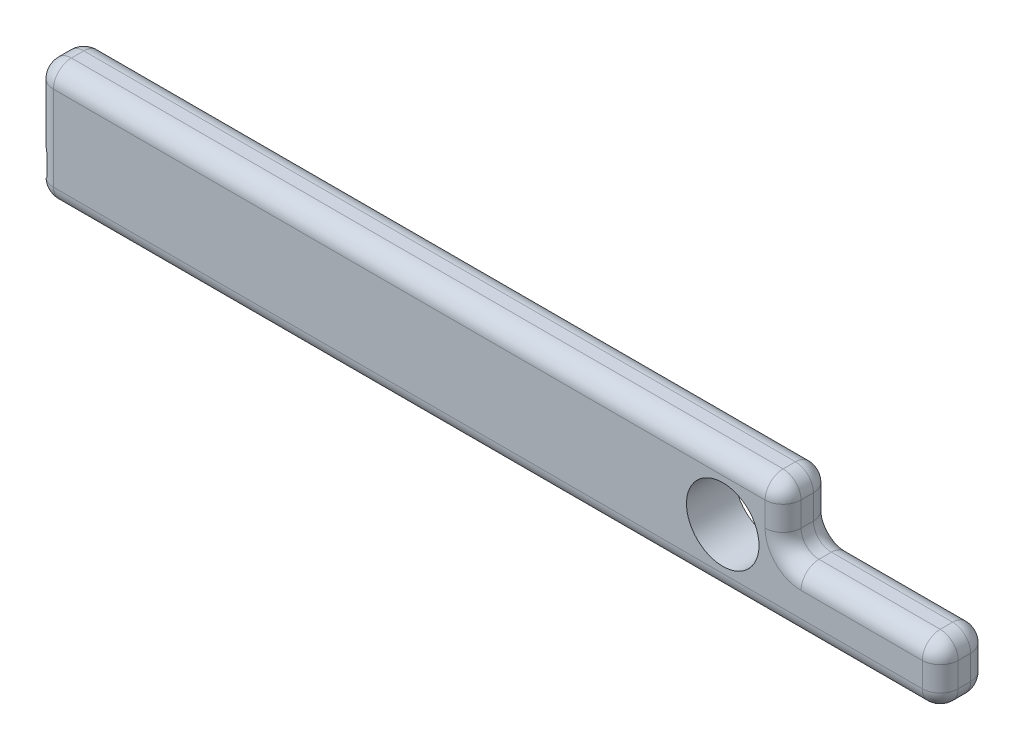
ISO-10303-21;
HEADER;
FILE_DESCRIPTION(('STEP AP214'),'2;1');
FILE_NAME('part.step','',(''),(''),'','','');
FILE_SCHEMA(('AUTOMOTIVE_DESIGN { 1 0 10303 214 1 1 1 1 }'));
ENDSEC;
DATA;
#1=APPLICATION_CONTEXT('core data for automotive mechanical design processes');
#2=APPLICATION_PROTOCOL_DEFINITION('international standard','automotive_design',2000,#1);
#3=PRODUCT_CONTEXT('',#1,'mechanical');
#4=PRODUCT('Part','Part','',(#3));
#5=PRODUCT_RELATED_PRODUCT_CATEGORY('part','',(#4));
#6=PRODUCT_DEFINITION_FORMATION('','',#4);
#7=PRODUCT_DEFINITION_CONTEXT('part definition',#1,'design');
#8=PRODUCT_DEFINITION('design','',#6,#7);
#9=PRODUCT_DEFINITION_SHAPE('','',#8);
#10=(LENGTH_UNIT() NAMED_UNIT(*) SI_UNIT(.MILLI.,.METRE.));
#11=(NAMED_UNIT(*) PLANE_ANGLE_UNIT() SI_UNIT($,.RADIAN.));
#12=(NAMED_UNIT(*) SI_UNIT($,.STERADIAN.) SOLID_ANGLE_UNIT());
#13=UNCERTAINTY_MEASURE_WITH_UNIT(LENGTH_MEASURE(1.E-05),#10,'distance_accuracy_value','');
#14=(GEOMETRIC_REPRESENTATION_CONTEXT(3) GLOBAL_UNCERTAINTY_ASSIGNED_CONTEXT((#13)) GLOBAL_UNIT_ASSIGNED_CONTEXT((#10,
#11,#12)) REPRESENTATION_CONTEXT('',''));
#15=CARTESIAN_POINT('',(0.,0.,0.));
#16=DIRECTION('',(0.,0.,1.));
#17=DIRECTION('',(1.,0.,0.));
#18=AXIS2_PLACEMENT_3D('',#15,#16,#17);
#19=CARTESIAN_POINT('',(26.2128,7.92479999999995,0.8128));
#20=DIRECTION('',(0.,1.,0.));
#21=DIRECTION('',(-1.,0.,0.));
#22=AXIS2_PLACEMENT_3D('',#19,#20,#21);
#23=CYLINDRICAL_SURFACE('',#22,2.3622);
#24=CARTESIAN_POINT('',(26.2128,-2.3622,0.8128));
#25=DIRECTION('',(0.,1.,0.));
#26=DIRECTION('',(-1.,0.,0.));
#27=AXIS2_PLACEMENT_3D('',#24,#25,#26);
#28=CIRCLE('',#27,2.3622);
#29=CARTESIAN_POINT('',(26.2128,-2.3622,3.175));
#30=VERTEX_POINT('',#29);
#31=CARTESIAN_POINT('',(28.575,-2.3622,0.812800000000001));
#32=VERTEX_POINT('',#31);
#33=EDGE_CURVE('E13',#30,#32,#28,.T.);
#34=ORIENTED_EDGE('',*,*,#33,.F.);
#35=DIRECTION('',(0.,1.,0.));
#36=VECTOR('',#35,1.);
#37=CARTESIAN_POINT('',(26.2128,7.92479999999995,3.175));
#38=LINE('',#37,#36);
#39=CARTESIAN_POINT('',(26.2128,-5.588,3.175));
#40=VERTEX_POINT('',#39);
#41=EDGE_CURVE('E310',#40,#30,#38,.T.);
#42=ORIENTED_EDGE('',*,*,#41,.F.);
#43=CARTESIAN_POINT('',(26.2128,-5.588,0.8128));
#44=DIRECTION('',(0.,1.,0.));
#45=DIRECTION('',(-1.,0.,0.));
#46=AXIS2_PLACEMENT_3D('',#43,#44,#45);
#47=CIRCLE('',#46,2.3622);
#48=CARTESIAN_POINT('',(28.575,-5.588,0.8128));
#49=VERTEX_POINT('',#48);
#50=EDGE_CURVE('E57',#40,#49,#47,.T.);
#51=ORIENTED_EDGE('',*,*,#50,.T.);
#52=DIRECTION('',(0.,1.,0.));
#53=VECTOR('',#52,1.);
#54=CARTESIAN_POINT('',(28.575,-7.9502,0.8128));
#55=LINE('',#54,#53);
#56=EDGE_CURVE('E284',#32,#49,#55,.F.);
#57=ORIENTED_EDGE('',*,*,#56,.F.);
#58=EDGE_LOOP('',(#34,#42,#51,#57));
#59=FACE_BOUND('',#58,.T.);
#60=ADVANCED_FACE('F48',(#59),#23,.T.);
#61=CARTESIAN_POINT('',(26.2128,-5.588,0.8128));
#62=DIRECTION('',(0.,0.,1.));
#63=DIRECTION('',(1.,0.,0.));
#64=AXIS2_PLACEMENT_3D('',#61,#62,#63);
#65=SPHERICAL_SURFACE('',#64,2.3622);
#66=ORIENTED_EDGE('',*,*,#50,.F.);
#67=CARTESIAN_POINT('',(26.2128,-5.588,0.8128));
#68=DIRECTION('',(1.,0.,0.));
#69=DIRECTION('',(0.,0.,-1.));
#70=AXIS2_PLACEMENT_3D('',#67,#68,#69);
#71=CIRCLE('',#70,2.3622);
#72=CARTESIAN_POINT('',(26.2128,-7.9502,0.8128));
#73=VERTEX_POINT('',#72);
#74=EDGE_CURVE('E334',#40,#73,#71,.T.);
#75=ORIENTED_EDGE('',*,*,#74,.T.);
#76=CARTESIAN_POINT('',(26.2128,-5.588,0.8128));
#77=DIRECTION('',(0.,0.,-1.));
#78=DIRECTION('',(-1.,0.,0.));
#79=AXIS2_PLACEMENT_3D('',#76,#77,#78);
#80=CIRCLE('',#79,2.3622);
#81=EDGE_CURVE('E290',#49,#73,#80,.T.);
#82=ORIENTED_EDGE('',*,*,#81,.F.);
#83=EDGE_LOOP('',(#66,#75,#82));
#84=FACE_BOUND('',#83,.T.);
#85=ADVANCED_FACE('F339',(#84),#65,.T.);
#86=CARTESIAN_POINT('',(-90.297,-5.588,0.8128));
#87=DIRECTION('',(1.,0.,0.));
#88=DIRECTION('',(0.,0.,-1.));
#89=AXIS2_PLACEMENT_3D('',#86,#87,#88);
#90=CYLINDRICAL_SURFACE('',#89,2.3622);
#91=ORIENTED_EDGE('',*,*,#74,.F.);
#92=DIRECTION('',(1.,0.,0.));
#93=VECTOR('',#92,1.);
#94=CARTESIAN_POINT('',(-90.297,-5.588,3.175));
#95=LINE('',#94,#93);
#96=CARTESIAN_POINT('',(-87.9348,-5.588,3.175));
#97=VERTEX_POINT('',#96);
#98=EDGE_CURVE('E313',#97,#40,#95,.T.);
#99=ORIENTED_EDGE('',*,*,#98,.F.);
#100=CARTESIAN_POINT('',(-87.9348,-5.588,0.8128));
#101=DIRECTION('',(1.,0.,0.));
#102=DIRECTION('',(0.,0.,-1.));
#103=AXIS2_PLACEMENT_3D('',#100,#101,#102);
#104=CIRCLE('',#103,2.3622);
#105=CARTESIAN_POINT('',(-87.9348,-7.9502,0.8128));
#106=VERTEX_POINT('',#105);
#107=EDGE_CURVE('E331',#97,#106,#104,.T.);
#108=ORIENTED_EDGE('',*,*,#107,.T.);
#109=DIRECTION('',(1.,0.,0.));
#110=VECTOR('',#109,1.);
#111=CARTESIAN_POINT('',(-90.297,-7.9502,0.8128));
#112=LINE('',#111,#110);
#113=EDGE_CURVE('E296',#73,#106,#112,.F.);
#114=ORIENTED_EDGE('',*,*,#113,.F.);
#115=EDGE_LOOP('',(#91,#99,#108,#114));
#116=FACE_BOUND('',#115,.T.);
#117=ADVANCED_FACE('F492',(#116),#90,.T.);
#118=CARTESIAN_POINT('',(-87.9348,-5.588,0.8128));
#119=DIRECTION('',(0.,0.,1.));
#120=DIRECTION('',(1.,0.,0.));
#121=AXIS2_PLACEMENT_3D('',#118,#119,#120);
#122=SPHERICAL_SURFACE('',#121,2.3622);
#123=CARTESIAN_POINT('',(-89.9096514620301,-6.88412904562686,0.8126));
#124=CARTESIAN_POINT('',(-89.9203523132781,-6.86784546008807,0.874150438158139));
#125=CARTESIAN_POINT('',(-89.9291557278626,-6.84960656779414,0.935512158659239));
#126=CARTESIAN_POINT('',(-89.9429635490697,-6.80931020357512,1.05740120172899));
#127=CARTESIAN_POINT('',(-89.9479680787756,-6.78725285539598,1.11792855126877));
#128=CARTESIAN_POINT('',(-89.9541651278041,-6.73948425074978,1.23751142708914));
#129=CARTESIAN_POINT('',(-89.9553693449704,-6.71378446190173,1.2965709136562));
#130=CARTESIAN_POINT('',(-89.9540005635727,-6.65887010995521,1.41296780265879));
#131=CARTESIAN_POINT('',(-89.9514276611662,-6.62965563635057,1.4703052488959));
#132=CARTESIAN_POINT('',(-89.9380307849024,-6.53700489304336,1.63923613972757));
#133=CARTESIAN_POINT('',(-89.9215281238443,-6.46856534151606,1.7477380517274));
#134=CARTESIAN_POINT('',(-89.8733809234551,-6.32091735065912,1.95357335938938));
#135=CARTESIAN_POINT('',(-89.8417243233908,-6.24170036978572,2.05089778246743));
#136=CARTESIAN_POINT('',(-89.7812547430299,-6.11386437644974,2.19083690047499));
#137=CARTESIAN_POINT('',(-89.757731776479,-6.06777140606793,2.23815653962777));
#138=CARTESIAN_POINT('',(-89.7062143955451,-5.97404949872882,2.32869916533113));
#139=CARTESIAN_POINT('',(-89.6782194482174,-5.92642037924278,2.37192166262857));
#140=CARTESIAN_POINT('',(-89.6177138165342,-5.83026544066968,2.45414700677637));
#141=CARTESIAN_POINT('',(-89.5851971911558,-5.78173851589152,2.49314418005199));
#142=CARTESIAN_POINT('',(-89.5156542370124,-5.68462315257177,2.566791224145));
#143=CARTESIAN_POINT('',(-89.478628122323,-5.6360347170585,2.60144130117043));
#144=CARTESIAN_POINT('',(-89.4393346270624,-5.58780000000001,2.63388878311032));
#145=B_SPLINE_CURVE_WITH_KNOTS('',3,(#123,#124,#125,#126,#127,#128,#129,#130,#131,#132,#133,
#134,#135,#136,#137,#138,#139,#140,#141,#142,#143,#144),.UNSPECIFIED.,.F.,.F.,(4,2,2,2,2,2,2,2,
2,2,4),(0.,0.193623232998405,0.387240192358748,0.580260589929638,0.773276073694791,
1.15933925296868,1.54571020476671,1.7558342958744,1.96598344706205,2.17641136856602,
2.38682930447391),.UNSPECIFIED.);
#146=CARTESIAN_POINT('',(-89.9096862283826,-6.88407608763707,0.8128));
#147=VERTEX_POINT('',#146);
#148=CARTESIAN_POINT('',(-89.4394975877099,-5.588,2.63375414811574));
#149=VERTEX_POINT('',#148);
#150=EDGE_CURVE('E507',#147,#149,#145,.T.);
#151=ORIENTED_EDGE('',*,*,#150,.F.);
#152=CARTESIAN_POINT('',(-87.9348,-5.588,0.8128));
#153=DIRECTION('',(0.,0.,1.));
#154=DIRECTION('',(1.,0.,0.));
#155=AXIS2_PLACEMENT_3D('',#152,#153,#154);
#156=CIRCLE('',#155,2.3622);
#157=EDGE_CURVE('E329',#147,#106,#156,.T.);
#158=ORIENTED_EDGE('',*,*,#157,.T.);
#159=ORIENTED_EDGE('',*,*,#107,.F.);
#160=CARTESIAN_POINT('',(-87.9348,-5.588,0.8128));
#161=DIRECTION('',(0.,-1.,0.));
#162=DIRECTION('',(0.,0.,-1.));
#163=AXIS2_PLACEMENT_3D('',#160,#161,#162);
#164=CIRCLE('',#163,2.3622);
#165=EDGE_CURVE('E308',#149,#97,#164,.F.);
#166=ORIENTED_EDGE('',*,*,#165,.F.);
#167=EDGE_LOOP('',(#151,#158,#159,#166));
#168=FACE_BOUND('',#167,.T.);
#169=ADVANCED_FACE('F497',(#168),#122,.T.);
#170=CARTESIAN_POINT('',(-87.9348,-5.588,3.175));
#171=DIRECTION('',(0.,0.,1.));
#172=DIRECTION('',(1.,0.,0.));
#173=AXIS2_PLACEMENT_3D('',#170,#171,#172);
#174=CYLINDRICAL_SURFACE('',#173,2.3622);
#175=CARTESIAN_POINT('',(-89.9096862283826,-6.88407608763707,-0.8128));
#176=CARTESIAN_POINT('',(-89.8971218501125,-6.90318926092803,-0.740658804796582));
#177=CARTESIAN_POINT('',(-89.8858389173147,-6.91980518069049,-0.667604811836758));
#178=CARTESIAN_POINT('',(-89.8663769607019,-6.94789490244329,-0.520055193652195));
#179=CARTESIAN_POINT('',(-89.8582002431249,-6.9593648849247,-0.445558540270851));
#180=CARTESIAN_POINT('',(-89.8456776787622,-6.97675620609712,-0.297573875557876));
#181=CARTESIAN_POINT('',(-89.8412373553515,-6.98281463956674,-0.224110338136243));
#182=CARTESIAN_POINT('',(-89.8361024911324,-6.98980342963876,-0.0768600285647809));
#183=CARTESIAN_POINT('',(-89.8354061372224,-6.99073626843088,-0.00307343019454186));
#184=CARTESIAN_POINT('',(-89.8386783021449,-6.98631414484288,0.195098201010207));
#185=CARTESIAN_POINT('',(-89.846184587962,-6.97619334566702,0.319380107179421));
#186=CARTESIAN_POINT('',(-89.8647442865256,-6.95013187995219,0.504823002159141));
#187=CARTESIAN_POINT('',(-89.8722759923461,-6.93944603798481,0.567173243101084));
#188=CARTESIAN_POINT('',(-89.8894722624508,-6.9144518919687,0.690817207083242));
#189=CARTESIAN_POINT('',(-89.8991358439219,-6.90014525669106,0.752111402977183));
#190=CARTESIAN_POINT('',(-89.9096862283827,-6.88407608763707,0.812799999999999));
#191=B_SPLINE_CURVE_WITH_KNOTS('',3,(#175,#176,#177,#178,#179,#180,#181,#182,#183,#184,#185,
#186,#187,#188,#189,#190),.UNSPECIFIED.,.F.,.F.,(4,2,2,2,2,2,2,4),(0.,0.227024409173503,
0.454217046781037,0.675475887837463,0.896627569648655,1.26988124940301,1.46087963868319,
1.65179015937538),.UNSPECIFIED.);
#192=CARTESIAN_POINT('',(-89.9096862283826,-6.88407608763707,-0.812799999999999));
#193=VERTEX_POINT('',#192);
#194=EDGE_CURVE('E514',#193,#147,#191,.T.);
#195=ORIENTED_EDGE('',*,*,#194,.F.);
#196=CARTESIAN_POINT('',(-87.9348,-5.588,-0.8128));
#197=DIRECTION('',(0.,0.,1.));
#198=DIRECTION('',(1.,0.,0.));
#199=AXIS2_PLACEMENT_3D('',#196,#197,#198);
#200=CIRCLE('',#199,2.3622);
#201=CARTESIAN_POINT('',(-87.9348,-7.9502,-0.8128));
#202=VERTEX_POINT('',#201);
#203=EDGE_CURVE('E327',#193,#202,#200,.T.);
#204=ORIENTED_EDGE('',*,*,#203,.T.);
#205=DIRECTION('',(0.,0.,1.));
#206=VECTOR('',#205,1.);
#207=CARTESIAN_POINT('',(-87.9348,-7.9502,3.175));
#208=LINE('',#207,#206);
#209=EDGE_CURVE('E299',#106,#202,#208,.F.);
#210=ORIENTED_EDGE('',*,*,#209,.F.);
#211=ORIENTED_EDGE('',*,*,#157,.F.);
#212=EDGE_LOOP('',(#195,#204,#210,#211));
#213=FACE_BOUND('',#212,.T.);
#214=ADVANCED_FACE('F502',(#213),#174,.T.);
#215=CARTESIAN_POINT('',(-87.9348,-5.588,-0.8128));
#216=DIRECTION('',(0.,0.,1.));
#217=DIRECTION('',(1.,0.,0.));
#218=AXIS2_PLACEMENT_3D('',#215,#216,#217);
#219=SPHERICAL_SURFACE('',#218,2.3622);
#220=CARTESIAN_POINT('',(-89.4393346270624,-5.5878,-2.63388878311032));
#221=CARTESIAN_POINT('',(-89.476403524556,-5.63330177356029,-2.60327655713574));
#222=CARTESIAN_POINT('',(-89.5114541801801,-5.67912060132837,-2.57070670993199));
#223=CARTESIAN_POINT('',(-89.5775385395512,-5.77073933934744,-2.50169856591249));
#224=CARTESIAN_POINT('',(-89.6085723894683,-5.81653925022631,-2.46526040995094));
#225=CARTESIAN_POINT('',(-89.6666265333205,-5.90744104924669,-2.38858507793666));
#226=CARTESIAN_POINT('',(-89.6936494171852,-5.95254337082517,-2.34835038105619));
#227=CARTESIAN_POINT('',(-89.7437101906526,-6.04148302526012,-2.2642011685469));
#228=CARTESIAN_POINT('',(-89.7667481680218,-6.08532038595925,-2.22028673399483));
#229=CARTESIAN_POINT('',(-89.829942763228,-6.21421978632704,-2.08314106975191));
#230=CARTESIAN_POINT('',(-89.8641571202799,-6.29663236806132,-1.98453797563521));
#231=CARTESIAN_POINT('',(-89.9165855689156,-6.45038562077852,-1.77526461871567));
#232=CARTESIAN_POINT('',(-89.9348094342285,-6.5217330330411,-1.6646017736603));
#233=CARTESIAN_POINT('',(-89.9501869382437,-6.61849745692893,-1.49156625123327));
#234=CARTESIAN_POINT('',(-89.9533108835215,-6.64911958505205,-1.43252521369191));
#235=CARTESIAN_POINT('',(-89.9555222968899,-6.70663041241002,-1.31255708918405));
#236=CARTESIAN_POINT('',(-89.9546096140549,-6.73351897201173,-1.25162993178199));
#237=CARTESIAN_POINT('',(-89.948735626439,-6.78342656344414,-1.12817742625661));
#238=CARTESIAN_POINT('',(-89.9437612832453,-6.80643284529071,-1.0656475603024));
#239=CARTESIAN_POINT('',(-89.9297513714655,-6.84836653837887,-0.939679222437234));
#240=CARTESIAN_POINT('',(-89.920715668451,-6.86729381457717,-0.876240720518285));
#241=CARTESIAN_POINT('',(-89.9096514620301,-6.88412904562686,-0.812600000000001));
#242=B_SPLINE_CURVE_WITH_KNOTS('',3,(#220,#221,#222,#223,#224,#225,#226,#227,#228,#229,#230,
#231,#232,#233,#234,#235,#236,#237,#238,#239,#240,#241),.UNSPECIFIED.,.F.,.F.,(4,2,2,2,2,2,2,2,
2,2,4),(0.,0.198511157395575,0.397015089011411,0.595390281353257,0.793761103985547,
1.19065968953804,1.5873155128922,1.78685181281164,1.98639557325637,2.18658242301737,
2.38677589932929),.UNSPECIFIED.);
#243=CARTESIAN_POINT('',(-89.4394975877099,-5.58800000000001,-2.63375414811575));
#244=VERTEX_POINT('',#243);
#245=EDGE_CURVE('E544',#244,#193,#242,.T.);
#246=ORIENTED_EDGE('',*,*,#245,.F.);
#247=CARTESIAN_POINT('',(-87.9348,-5.588,-0.8128));
#248=DIRECTION('',(0.,1.,0.));
#249=DIRECTION('',(0.,0.,1.));
#250=AXIS2_PLACEMENT_3D('',#247,#248,#249);
#251=CIRCLE('',#250,2.3622);
#252=CARTESIAN_POINT('',(-87.9348,-5.588,-3.175));
#253=VERTEX_POINT('',#252);
#254=EDGE_CURVE('E305',#253,#244,#251,.T.);
#255=ORIENTED_EDGE('',*,*,#254,.F.);
#256=CARTESIAN_POINT('',(-87.9348,-5.588,-0.8128));
#257=DIRECTION('',(-1.,0.,0.));
#258=DIRECTION('',(0.,0.,1.));
#259=AXIS2_PLACEMENT_3D('',#256,#257,#258);
#260=CIRCLE('',#259,2.3622);
#261=EDGE_CURVE('E324',#253,#202,#260,.T.);
#262=ORIENTED_EDGE('',*,*,#261,.T.);
#263=ORIENTED_EDGE('',*,*,#203,.F.);
#264=EDGE_LOOP('',(#246,#255,#262,#263));
#265=FACE_BOUND('',#264,.T.);
#266=ADVANCED_FACE('F588',(#265),#219,.T.);
#267=CARTESIAN_POINT('',(-90.297,-5.588,-0.8128));
#268=DIRECTION('',(1.,0.,0.));
#269=DIRECTION('',(0.,0.,-1.));
#270=AXIS2_PLACEMENT_3D('',#267,#268,#269);
#271=CYLINDRICAL_SURFACE('',#270,2.3622);
#272=ORIENTED_EDGE('',*,*,#261,.F.);
#273=DIRECTION('',(-1.,0.,0.));
#274=VECTOR('',#273,1.);
#275=CARTESIAN_POINT('',(-90.297,-5.588,-3.175));
#276=LINE('',#275,#274);
#277=CARTESIAN_POINT('',(26.2128,-5.588,-3.175));
#278=VERTEX_POINT('',#277);
#279=EDGE_CURVE('E278',#278,#253,#276,.T.);
#280=ORIENTED_EDGE('',*,*,#279,.F.);
#281=CARTESIAN_POINT('',(26.2128,-5.588,-0.8128));
#282=DIRECTION('',(-1.,0.,0.));
#283=DIRECTION('',(0.,0.,1.));
#284=AXIS2_PLACEMENT_3D('',#281,#282,#283);
#285=CIRCLE('',#284,2.3622);
#286=CARTESIAN_POINT('',(26.2128,-7.9502,-0.8128));
#287=VERTEX_POINT('',#286);
#288=EDGE_CURVE('E322',#278,#287,#285,.T.);
#289=ORIENTED_EDGE('',*,*,#288,.T.);
#290=DIRECTION('',(-1.,0.,0.));
#291=VECTOR('',#290,1.);
#292=CARTESIAN_POINT('',(-90.297,-7.9502,-0.8128));
#293=LINE('',#292,#291);
#294=EDGE_CURVE('E302',#202,#287,#293,.F.);
#295=ORIENTED_EDGE('',*,*,#294,.F.);
#296=EDGE_LOOP('',(#272,#280,#289,#295));
#297=FACE_BOUND('',#296,.T.);
#298=ADVANCED_FACE('F586',(#297),#271,.T.);
#299=CARTESIAN_POINT('',(26.2128,-5.588,-0.8128));
#300=DIRECTION('',(0.,0.,1.));
#301=DIRECTION('',(1.,0.,0.));
#302=AXIS2_PLACEMENT_3D('',#299,#300,#301);
#303=SPHERICAL_SURFACE('',#302,2.3622);
#304=ORIENTED_EDGE('',*,*,#288,.F.);
#305=CARTESIAN_POINT('',(26.2128,-5.588,-0.8128));
#306=DIRECTION('',(0.,-1.,0.));
#307=DIRECTION('',(1.,0.,0.));
#308=AXIS2_PLACEMENT_3D('',#305,#306,#307);
#309=CIRCLE('',#308,2.3622);
#310=CARTESIAN_POINT('',(28.575,-5.588,-0.8128));
#311=VERTEX_POINT('',#310);
#312=EDGE_CURVE('E320',#278,#311,#309,.T.);
#313=ORIENTED_EDGE('',*,*,#312,.T.);
#314=CARTESIAN_POINT('',(26.2128,-5.588,-0.8128));
#315=DIRECTION('',(0.,0.,-1.));
#316=DIRECTION('',(-1.,0.,0.));
#317=AXIS2_PLACEMENT_3D('',#314,#315,#316);
#318=CIRCLE('',#317,2.3622);
#319=EDGE_CURVE('E293',#287,#311,#318,.F.);
#320=ORIENTED_EDGE('',*,*,#319,.F.);
#321=EDGE_LOOP('',(#304,#313,#320));
#322=FACE_BOUND('',#321,.T.);
#323=ADVANCED_FACE('F583',(#322),#303,.T.);
#324=CARTESIAN_POINT('',(26.2128,7.92479999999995,-0.8128));
#325=DIRECTION('',(0.,1.,0.));
#326=DIRECTION('',(-1.,0.,0.));
#327=AXIS2_PLACEMENT_3D('',#324,#325,#326);
#328=CYLINDRICAL_SURFACE('',#327,2.3622);
#329=ORIENTED_EDGE('',*,*,#312,.F.);
#330=DIRECTION('',(0.,-1.,0.));
#331=VECTOR('',#330,1.);
#332=CARTESIAN_POINT('',(26.2128,7.92479999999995,-3.175));
#333=LINE('',#332,#331);
#334=CARTESIAN_POINT('',(26.2128,-2.3622,-3.175));
#335=VERTEX_POINT('',#334);
#336=EDGE_CURVE('E281',#335,#278,#333,.T.);
#337=ORIENTED_EDGE('',*,*,#336,.F.);
#338=CARTESIAN_POINT('',(26.2128,-2.3622,-0.8128));
#339=DIRECTION('',(0.,-1.,0.));
#340=DIRECTION('',(1.,0.,0.));
#341=AXIS2_PLACEMENT_3D('',#338,#339,#340);
#342=CIRCLE('',#341,2.3622);
#343=CARTESIAN_POINT('',(28.575,-2.3622,-0.8128));
#344=VERTEX_POINT('',#343);
#345=EDGE_CURVE('E318',#335,#344,#342,.T.);
#346=ORIENTED_EDGE('',*,*,#345,.T.);
#347=DIRECTION('',(0.,-1.,0.));
#348=VECTOR('',#347,1.);
#349=CARTESIAN_POINT('',(28.575,7.92479999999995,-0.8128));
#350=LINE('',#349,#348);
#351=EDGE_CURVE('E287',#311,#344,#350,.F.);
#352=ORIENTED_EDGE('',*,*,#351,.F.);
#353=EDGE_LOOP('',(#329,#337,#346,#352));
#354=FACE_BOUND('',#353,.T.);
#355=ADVANCED_FACE('F355',(#354),#328,.T.);
#356=CARTESIAN_POINT('',(26.2128,-2.3622,-0.8128));
#357=DIRECTION('',(0.,0.,1.));
#358=DIRECTION('',(1.,0.,0.));
#359=AXIS2_PLACEMENT_3D('',#356,#357,#358);
#360=SPHERICAL_SURFACE('',#359,2.3622);
#361=ORIENTED_EDGE('',*,*,#345,.F.);
#362=CARTESIAN_POINT('',(26.2128,-2.3622,-0.8128));
#363=DIRECTION('',(1.,0.,0.));
#364=DIRECTION('',(0.,0.,-1.));
#365=AXIS2_PLACEMENT_3D('',#362,#363,#364);
#366=CIRCLE('',#365,2.3622);
#367=CARTESIAN_POINT('',(26.2128,0.,-0.8128));
#368=VERTEX_POINT('',#367);
#369=EDGE_CURVE('E270',#368,#335,#366,.F.);
#370=ORIENTED_EDGE('',*,*,#369,.F.);
#371=CARTESIAN_POINT('',(26.2128,-2.3622,-0.812800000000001));
#372=DIRECTION('',(0.,0.,1.));
#373=DIRECTION('',(1.,0.,0.));
#374=AXIS2_PLACEMENT_3D('',#371,#372,#373);
#375=CIRCLE('',#374,2.3622);
#376=EDGE_CURVE('E276',#344,#368,#375,.T.);
#377=ORIENTED_EDGE('',*,*,#376,.F.);
#378=EDGE_LOOP('',(#361,#370,#377));
#379=FACE_BOUND('',#378,.T.);
#380=ADVANCED_FACE('F360',(#379),#360,.T.);
#381=CARTESIAN_POINT('',(26.2128,-2.3622,0.812800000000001));
#382=DIRECTION('',(0.,0.,1.));
#383=DIRECTION('',(1.,0.,0.));
#384=AXIS2_PLACEMENT_3D('',#381,#382,#383);
#385=SPHERICAL_SURFACE('',#384,2.3622);
#386=CARTESIAN_POINT('',(26.2128,-2.3622,0.812800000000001));
#387=DIRECTION('',(-1.,0.,0.));
#388=DIRECTION('',(0.,0.,1.));
#389=AXIS2_PLACEMENT_3D('',#386,#387,#388);
#390=CIRCLE('',#389,2.3622);
#391=CARTESIAN_POINT('',(26.2128,0.,0.812800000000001));
#392=VERTEX_POINT('',#391);
#393=EDGE_CURVE('E316',#30,#392,#390,.T.);
#394=ORIENTED_EDGE('',*,*,#393,.F.);
#395=ORIENTED_EDGE('',*,*,#33,.T.);
#396=CARTESIAN_POINT('',(26.2128,-2.3622,0.812800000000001));
#397=DIRECTION('',(0.,0.,1.));
#398=DIRECTION('',(1.,0.,0.));
#399=AXIS2_PLACEMENT_3D('',#396,#397,#398);
#400=CIRCLE('',#399,2.3622);
#401=EDGE_CURVE('E273',#392,#32,#400,.F.);
#402=ORIENTED_EDGE('',*,*,#401,.F.);
#403=EDGE_LOOP('',(#394,#395,#402));
#404=FACE_BOUND('',#403,.T.);
#405=ADVANCED_FACE('F50',(#404),#385,.T.);
#406=CARTESIAN_POINT('',(26.2128,-5.588,3.175));
#407=DIRECTION('',(0.,0.,-1.));
#408=DIRECTION('',(-1.,0.,0.));
#409=AXIS2_PLACEMENT_3D('',#406,#407,#408);
#410=CYLINDRICAL_SURFACE('',#409,2.3622);
#411=DIRECTION('',(0.,0.,-1.));
#412=VECTOR('',#411,1.);
#413=CARTESIAN_POINT('',(26.2128,-7.9502,3.175));
#414=LINE('',#413,#412);
#415=EDGE_CURVE('E267',#287,#73,#414,.F.);
#416=ORIENTED_EDGE('',*,*,#415,.F.);
#417=ORIENTED_EDGE('',*,*,#319,.T.);
#418=DIRECTION('',(0.,0.,-1.));
#419=VECTOR('',#418,1.);
#420=CARTESIAN_POINT('',(28.575,-5.588,3.175));
#421=LINE('',#420,#419);
#422=EDGE_CURVE('E264',#49,#311,#421,.T.);
#423=ORIENTED_EDGE('',*,*,#422,.F.);
#424=ORIENTED_EDGE('',*,*,#81,.T.);
#425=EDGE_LOOP('',(#416,#417,#423,#424));
#426=FACE_BOUND('',#425,.T.);
#427=ADVANCED_FACE('F349',(#426),#410,.T.);
#428=CARTESIAN_POINT('',(-87.9348,5.5626,0.8128));
#429=DIRECTION('',(0.,0.,1.));
#430=DIRECTION('',(1.,0.,0.));
#431=AXIS2_PLACEMENT_3D('',#428,#429,#430);
#432=SPHERICAL_SURFACE('',#431,2.3622);
#433=CARTESIAN_POINT('',(-87.9348,5.5626,0.8128));
#434=DIRECTION('',(0.,-1.,0.));
#435=DIRECTION('',(0.,0.,-1.));
#436=AXIS2_PLACEMENT_3D('',#433,#434,#435);
#437=CIRCLE('',#436,2.3622);
#438=CARTESIAN_POINT('',(-87.9348,5.5626,3.175));
#439=VERTEX_POINT('',#438);
#440=CARTESIAN_POINT('',(-90.297,5.5626,0.8128));
#441=VERTEX_POINT('',#440);
#442=EDGE_CURVE('E261',#439,#441,#437,.T.);
#443=ORIENTED_EDGE('',*,*,#442,.F.);
#444=CARTESIAN_POINT('',(-87.9348,5.5626,0.8128));
#445=DIRECTION('',(-1.,0.,0.));
#446=DIRECTION('',(0.,0.,1.));
#447=AXIS2_PLACEMENT_3D('',#444,#445,#446);
#448=CIRCLE('',#447,2.3622);
#449=CARTESIAN_POINT('',(-87.9348,7.9248,0.8128));
#450=VERTEX_POINT('',#449);
#451=EDGE_CURVE('E259',#439,#450,#448,.T.);
#452=ORIENTED_EDGE('',*,*,#451,.T.);
#453=CARTESIAN_POINT('',(-87.9348,5.5626,0.8128));
#454=DIRECTION('',(0.,0.,1.));
#455=DIRECTION('',(1.,0.,0.));
#456=AXIS2_PLACEMENT_3D('',#453,#454,#455);
#457=CIRCLE('',#456,2.3622);
#458=EDGE_CURVE('E252',#441,#450,#457,.F.);
#459=ORIENTED_EDGE('',*,*,#458,.F.);
#460=EDGE_LOOP('',(#443,#452,#459));
#461=FACE_BOUND('',#460,.T.);
#462=ADVANCED_FACE('F485',(#461),#432,.T.);
#463=CARTESIAN_POINT('',(-90.297,5.5626,0.8128));
#464=DIRECTION('',(-1.,0.,0.));
#465=DIRECTION('',(0.,0.,1.));
#466=AXIS2_PLACEMENT_3D('',#463,#464,#465);
#467=CYLINDRICAL_SURFACE('',#466,2.3622);
#468=ORIENTED_EDGE('',*,*,#451,.F.);
#469=DIRECTION('',(-1.,0.,0.));
#470=VECTOR('',#469,1.);
#471=CARTESIAN_POINT('',(-90.297,5.5626,3.175));
#472=LINE('',#471,#470);
#473=CARTESIAN_POINT('',(5.5626,5.5626,3.175));
#474=VERTEX_POINT('',#473);
#475=EDGE_CURVE('E246',#474,#439,#472,.T.);
#476=ORIENTED_EDGE('',*,*,#475,.F.);
#477=CARTESIAN_POINT('',(5.5626,5.5626,0.8128));
#478=DIRECTION('',(-1.,0.,0.));
#479=DIRECTION('',(0.,0.,1.));
#480=AXIS2_PLACEMENT_3D('',#477,#478,#479);
#481=CIRCLE('',#480,2.3622);
#482=CARTESIAN_POINT('',(5.5626,7.9248,0.8128));
#483=VERTEX_POINT('',#482);
#484=EDGE_CURVE('E257',#474,#483,#481,.T.);
#485=ORIENTED_EDGE('',*,*,#484,.T.);
#486=DIRECTION('',(-1.,0.,0.));
#487=VECTOR('',#486,1.);
#488=CARTESIAN_POINT('',(-90.297,7.9248,0.8128));
#489=LINE('',#488,#487);
#490=EDGE_CURVE('E249',#450,#483,#489,.F.);
#491=ORIENTED_EDGE('',*,*,#490,.F.);
#492=EDGE_LOOP('',(#468,#476,#485,#491));
#493=FACE_BOUND('',#492,.T.);
#494=ADVANCED_FACE('F569',(#493),#467,.T.);
#495=CARTESIAN_POINT('',(5.5626,5.5626,0.8128));
#496=DIRECTION('',(0.,0.,1.));
#497=DIRECTION('',(1.,0.,0.));
#498=AXIS2_PLACEMENT_3D('',#495,#496,#497);
#499=SPHERICAL_SURFACE('',#498,2.3622);
#500=ORIENTED_EDGE('',*,*,#484,.F.);
#501=CARTESIAN_POINT('',(5.5626,5.5626,0.8128));
#502=DIRECTION('',(0.,1.,0.));
#503=DIRECTION('',(0.,0.,1.));
#504=AXIS2_PLACEMENT_3D('',#501,#502,#503);
#505=CIRCLE('',#504,2.3622);
#506=CARTESIAN_POINT('',(7.9248,5.5626,0.8128));
#507=VERTEX_POINT('',#506);
#508=EDGE_CURVE('E238',#507,#474,#505,.F.);
#509=ORIENTED_EDGE('',*,*,#508,.F.);
#510=CARTESIAN_POINT('',(5.5626,5.5626,0.8128));
#511=DIRECTION('',(0.,0.,-1.));
#512=DIRECTION('',(-1.,0.,0.));
#513=AXIS2_PLACEMENT_3D('',#510,#511,#512);
#514=CIRCLE('',#513,2.3622);
#515=EDGE_CURVE('E241',#483,#507,#514,.T.);
#516=ORIENTED_EDGE('',*,*,#515,.F.);
#517=EDGE_LOOP('',(#500,#509,#516));
#518=FACE_BOUND('',#517,.T.);
#519=ADVANCED_FACE('F564',(#518),#499,.T.);
#520=CARTESIAN_POINT('',(-87.9348,7.9248,0.8128));
#521=DIRECTION('',(0.,-1.,0.));
#522=DIRECTION('',(0.,0.,-1.));
#523=AXIS2_PLACEMENT_3D('',#520,#521,#522);
#524=CYLINDRICAL_SURFACE('',#523,2.3622);
#525=CARTESIAN_POINT('',(-89.4394975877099,-5.588,2.63375414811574));
#526=CARTESIAN_POINT('',(-89.4066985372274,-5.54774322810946,2.66085495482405));
#527=CARTESIAN_POINT('',(-89.3734314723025,-5.50713293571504,2.6868550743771));
#528=CARTESIAN_POINT('',(-89.3061158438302,-5.42534705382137,2.73665901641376));
#529=CARTESIAN_POINT('',(-89.272068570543,-5.38417243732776,2.76046617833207));
#530=CARTESIAN_POINT('',(-89.2032458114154,-5.30127565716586,2.80597230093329));
#531=CARTESIAN_POINT('',(-89.1684703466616,-5.25955350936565,2.82767132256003));
#532=CARTESIAN_POINT('',(-89.0982232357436,-5.17556197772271,2.86903389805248));
#533=CARTESIAN_POINT('',(-89.0627505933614,-5.13329184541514,2.88869424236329));
#534=CARTESIAN_POINT('',(-89.0269999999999,-5.09081333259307,2.90733765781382));
#535=B_SPLINE_CURVE_WITH_KNOTS('',3,(#525,#526,#527,#528,#529,#530,#531,#532,#533,#534),
.UNSPECIFIED.,.F.,.F.,(4,2,2,2,4),(0.,0.175700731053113,0.351129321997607,0.526552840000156,
0.702248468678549),.UNSPECIFIED.);
#536=CARTESIAN_POINT('',(-89.027,-5.09081333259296,2.90733765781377));
#537=VERTEX_POINT('',#536);
#538=EDGE_CURVE('E219',#149,#537,#535,.T.);
#539=ORIENTED_EDGE('',*,*,#538,.F.);
#540=ORIENTED_EDGE('',*,*,#165,.T.);
#541=DIRECTION('',(0.,-1.,0.));
#542=VECTOR('',#541,1.);
#543=CARTESIAN_POINT('',(-87.9348,7.9248,3.175));
#544=LINE('',#543,#542);
#545=EDGE_CURVE('E243',#439,#97,#544,.T.);
#546=ORIENTED_EDGE('',*,*,#545,.F.);
#547=ORIENTED_EDGE('',*,*,#442,.T.);
#548=DIRECTION('',(0.,-1.,0.));
#549=VECTOR('',#548,1.);
#550=CARTESIAN_POINT('',(-90.297,-7.9502,0.8128));
#551=LINE('',#550,#549);
#552=CARTESIAN_POINT('',(-90.297,-0.74567852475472,0.8128));
#553=VERTEX_POINT('',#552);
#554=EDGE_CURVE('E255',#553,#441,#551,.F.);
#555=ORIENTED_EDGE('',*,*,#554,.F.);
#556=CARTESIAN_POINT('',(-89.027,-2.53894127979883,2.90733765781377));
#557=CARTESIAN_POINT('',(-89.0874807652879,-2.46707417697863,2.8757885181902));
#558=CARTESIAN_POINT('',(-89.1471829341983,-2.39579051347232,2.84133409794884));
#559=CARTESIAN_POINT('',(-89.2646412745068,-2.25465246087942,2.76635724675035));
#560=CARTESIAN_POINT('',(-89.3223948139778,-2.18480005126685,2.7258269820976));
#561=CARTESIAN_POINT('',(-89.4359689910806,-2.04629073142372,2.63808807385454));
#562=CARTESIAN_POINT('',(-89.4917647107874,-1.97765260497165,2.59081705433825));
#563=CARTESIAN_POINT('',(-89.6001633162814,-1.84281189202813,2.48971528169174));
#564=CARTESIAN_POINT('',(-89.6527678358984,-1.77660806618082,2.43588792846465));
#565=CARTESIAN_POINT('',(-89.7836594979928,-1.60939101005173,2.28804869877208));
#566=CARTESIAN_POINT('',(-89.8590617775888,-1.51055985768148,2.18889073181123));
#567=CARTESIAN_POINT('',(-89.9962853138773,-1.32341362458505,1.97319814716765));
#568=CARTESIAN_POINT('',(-90.058147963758,-1.23506688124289,1.85671837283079));
#569=CARTESIAN_POINT('',(-90.1529075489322,-1.0890416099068,1.63234114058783));
#570=CARTESIAN_POINT('',(-90.1891392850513,-1.02878379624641,1.52754314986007));
#571=CARTESIAN_POINT('',(-90.2471436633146,-0.919517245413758,1.30857845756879));
#572=CARTESIAN_POINT('',(-90.2689519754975,-0.870480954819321,1.19443565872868));
#573=CARTESIAN_POINT('',(-90.2870459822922,-0.812537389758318,1.03378620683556));
#574=CARTESIAN_POINT('',(-90.2907523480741,-0.797842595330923,0.990081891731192));
#575=CARTESIAN_POINT('',(-90.2957291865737,-0.770333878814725,0.901946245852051));
#576=CARTESIAN_POINT('',(-90.2969994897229,-0.757520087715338,0.857514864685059));
#577=CARTESIAN_POINT('',(-90.297,-0.745678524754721,0.8128));
#578=B_SPLINE_CURVE_WITH_KNOTS('',3,(#556,#557,#558,#559,#560,#561,#562,#563,#564,#565,#566,
#567,#568,#569,#570,#571,#572,#573,#574,#575,#576,#577),.UNSPECIFIED.,.F.,.F.,(4,2,2,2,2,2,2,2,
2,2,4),(0.,0.297250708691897,0.594888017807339,0.895483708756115,1.19592417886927,
1.67133702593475,2.14527549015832,2.52249598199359,2.89878006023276,3.03746385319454,
3.1761572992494),.UNSPECIFIED.);
#579=CARTESIAN_POINT('',(-89.027,-2.53894127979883,2.90733765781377));
#580=VERTEX_POINT('',#579);
#581=EDGE_CURVE('E64',#580,#553,#578,.T.);
#582=ORIENTED_EDGE('',*,*,#581,.F.);
#583=DIRECTION('',(0.,-1.,0.));
#584=VECTOR('',#583,1.);
#585=CARTESIAN_POINT('',(-89.027,7.9248,2.90733765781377));
#586=LINE('',#585,#584);
#587=EDGE_CURVE('E902',#580,#537,#586,.T.);
#588=ORIENTED_EDGE('',*,*,#587,.T.);
#589=EDGE_LOOP('',(#539,#540,#546,#547,#555,#582,#588));
#590=FACE_BOUND('',#589,.T.);
#591=ADVANCED_FACE('F568',(#590),#524,.T.);
#592=CARTESIAN_POINT('',(-87.9348,5.5626,-0.8128));
#593=DIRECTION('',(0.,0.,1.));
#594=DIRECTION('',(1.,0.,0.));
#595=AXIS2_PLACEMENT_3D('',#592,#593,#594);
#596=SPHERICAL_SURFACE('',#595,2.3622);
#597=CARTESIAN_POINT('',(-87.9348,5.5626,-0.8128));
#598=DIRECTION('',(0.,-1.,0.));
#599=DIRECTION('',(0.,0.,-1.));
#600=AXIS2_PLACEMENT_3D('',#597,#598,#599);
#601=CIRCLE('',#600,2.3622);
#602=CARTESIAN_POINT('',(-90.297,5.5626,-0.8128));
#603=VERTEX_POINT('',#602);
#604=CARTESIAN_POINT('',(-87.9348,5.5626,-3.175));
#605=VERTEX_POINT('',#604);
#606=EDGE_CURVE('E236',#603,#605,#601,.T.);
#607=ORIENTED_EDGE('',*,*,#606,.F.);
#608=CARTESIAN_POINT('',(-87.9348,5.5626,-0.8128));
#609=DIRECTION('',(0.,0.,1.));
#610=DIRECTION('',(1.,0.,0.));
#611=AXIS2_PLACEMENT_3D('',#608,#609,#610);
#612=CIRCLE('',#611,2.3622);
#613=CARTESIAN_POINT('',(-87.9348,7.9248,-0.8128));
#614=VERTEX_POINT('',#613);
#615=EDGE_CURVE('E226',#614,#603,#612,.T.);
#616=ORIENTED_EDGE('',*,*,#615,.F.);
#617=CARTESIAN_POINT('',(-87.9348,5.5626,-0.8128));
#618=DIRECTION('',(-1.,0.,0.));
#619=DIRECTION('',(0.,0.,1.));
#620=AXIS2_PLACEMENT_3D('',#617,#618,#619);
#621=CIRCLE('',#620,2.3622);
#622=EDGE_CURVE('E228',#614,#605,#621,.T.);
#623=ORIENTED_EDGE('',*,*,#622,.T.);
#624=EDGE_LOOP('',(#607,#616,#623));
#625=FACE_BOUND('',#624,.T.);
#626=ADVANCED_FACE('F562',(#625),#596,.T.);
#627=CARTESIAN_POINT('',(-90.297,5.5626,-0.8128));
#628=DIRECTION('',(1.,0.,0.));
#629=DIRECTION('',(0.,0.,-1.));
#630=AXIS2_PLACEMENT_3D('',#627,#628,#629);
#631=CYLINDRICAL_SURFACE('',#630,2.3622);
#632=ORIENTED_EDGE('',*,*,#622,.F.);
#633=DIRECTION('',(-1.,0.,0.));
#634=VECTOR('',#633,1.);
#635=CARTESIAN_POINT('',(-90.297,7.9248,-0.8128));
#636=LINE('',#635,#634);
#637=CARTESIAN_POINT('',(5.5626,7.9248,-0.8128));
#638=VERTEX_POINT('',#637);
#639=EDGE_CURVE('E403',#638,#614,#636,.T.);
#640=ORIENTED_EDGE('',*,*,#639,.F.);
#641=CARTESIAN_POINT('',(5.5626,5.5626,-0.812800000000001));
#642=DIRECTION('',(-1.,0.,0.));
#643=DIRECTION('',(0.,0.,1.));
#644=AXIS2_PLACEMENT_3D('',#641,#642,#643);
#645=CIRCLE('',#644,2.3622);
#646=CARTESIAN_POINT('',(5.5626,5.5626,-3.175));
#647=VERTEX_POINT('',#646);
#648=EDGE_CURVE('E225',#638,#647,#645,.T.);
#649=ORIENTED_EDGE('',*,*,#648,.T.);
#650=DIRECTION('',(-1.,0.,0.));
#651=VECTOR('',#650,1.);
#652=CARTESIAN_POINT('',(-90.297,5.5626,-3.175));
#653=LINE('',#652,#651);
#654=EDGE_CURVE('E230',#605,#647,#653,.F.);
#655=ORIENTED_EDGE('',*,*,#654,.F.);
#656=EDGE_LOOP('',(#632,#640,#649,#655));
#657=FACE_BOUND('',#656,.T.);
#658=ADVANCED_FACE('F603',(#657),#631,.T.);
#659=CARTESIAN_POINT('',(5.5626,5.5626,-0.812800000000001));
#660=DIRECTION('',(0.,0.,1.));
#661=DIRECTION('',(1.,0.,0.));
#662=AXIS2_PLACEMENT_3D('',#659,#660,#661);
#663=SPHERICAL_SURFACE('',#662,2.3622);
#664=ORIENTED_EDGE('',*,*,#648,.F.);
#665=CARTESIAN_POINT('',(5.5626,5.5626,-0.812800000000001));
#666=DIRECTION('',(0.,0.,-1.));
#667=DIRECTION('',(-1.,0.,0.));
#668=AXIS2_PLACEMENT_3D('',#665,#666,#667);
#669=CIRCLE('',#668,2.3622);
#670=CARTESIAN_POINT('',(7.9248,5.5626,-0.812800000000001));
#671=VERTEX_POINT('',#670);
#672=EDGE_CURVE('E398',#671,#638,#669,.F.);
#673=ORIENTED_EDGE('',*,*,#672,.F.);
#674=CARTESIAN_POINT('',(5.5626,5.5626,-0.812800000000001));
#675=DIRECTION('',(0.,-1.,0.));
#676=DIRECTION('',(0.,0.,-1.));
#677=AXIS2_PLACEMENT_3D('',#674,#675,#676);
#678=CIRCLE('',#677,2.3622);
#679=EDGE_CURVE('E401',#647,#671,#678,.T.);
#680=ORIENTED_EDGE('',*,*,#679,.F.);
#681=EDGE_LOOP('',(#664,#673,#680));
#682=FACE_BOUND('',#681,.T.);
#683=ADVANCED_FACE('F422',(#682),#663,.T.);
#684=CARTESIAN_POINT('',(-87.9348,-7.9502,-0.8128));
#685=DIRECTION('',(0.,1.,0.));
#686=DIRECTION('',(0.,0.,1.));
#687=AXIS2_PLACEMENT_3D('',#684,#685,#686);
#688=CYLINDRICAL_SURFACE('',#687,2.3622);
#689=CARTESIAN_POINT('',(-90.297,-0.74567852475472,-0.8128));
#690=CARTESIAN_POINT('',(-90.297011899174,-0.762354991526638,-0.875833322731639));
#691=CARTESIAN_POINT('',(-90.2944779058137,-0.780994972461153,-0.938314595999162));
#692=CARTESIAN_POINT('',(-90.2846696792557,-0.82191866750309,-1.06160739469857));
#693=CARTESIAN_POINT('',(-90.2774015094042,-0.844197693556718,-1.12242095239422));
#694=CARTESIAN_POINT('',(-90.2585654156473,-0.891930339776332,-1.24140348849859));
#695=CARTESIAN_POINT('',(-90.2470393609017,-0.917351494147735,-1.2995922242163));
#696=CARTESIAN_POINT('',(-90.2200690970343,-0.971231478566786,-1.41360666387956));
#697=CARTESIAN_POINT('',(-90.2046237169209,-0.999691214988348,-1.46943165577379));
#698=CARTESIAN_POINT('',(-90.1531744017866,-1.08885572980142,-1.63238480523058));
#699=CARTESIAN_POINT('',(-90.1119377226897,-1.15363252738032,-1.7356942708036));
#700=CARTESIAN_POINT('',(-90.018339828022,-1.29182604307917,-1.93112655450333));
#701=CARTESIAN_POINT('',(-89.9659447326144,-1.36526876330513,-2.02321392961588));
#702=CARTESIAN_POINT('',(-89.8202182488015,-1.56254145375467,-2.245105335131));
#703=CARTESIAN_POINT('',(-89.7205808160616,-1.69122267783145,-2.36647265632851));
#704=CARTESIAN_POINT('',(-89.5073800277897,-1.95917401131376,-2.5819827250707));
#705=CARTESIAN_POINT('',(-89.3938022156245,-2.09845505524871,-2.67609686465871));
#706=CARTESIAN_POINT('',(-89.2352133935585,-2.29005277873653,-2.78544651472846));
#707=CARTESIAN_POINT('',(-89.1941118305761,-2.33946537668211,-2.81191869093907));
#708=CARTESIAN_POINT('',(-89.1111384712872,-2.43879865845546,-2.86183681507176));
#709=CARTESIAN_POINT('',(-89.0692702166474,-2.48871668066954,-2.88529393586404));
#710=CARTESIAN_POINT('',(-89.027,-2.5389412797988,-2.90733765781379));
#711=B_SPLINE_CURVE_WITH_KNOTS('',3,(#689,#690,#691,#692,#693,#694,#695,#696,#697,#698,#699,
#700,#701,#702,#703,#704,#705,#706,#707,#708,#709,#710),.UNSPECIFIED.,.F.,.F.,(4,2,2,2,2,2,2,2,
2,2,4),(0.,0.19547856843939,0.390707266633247,0.584065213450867,0.777480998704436,
1.16203414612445,1.54777198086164,2.1534721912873,2.75980592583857,2.96828942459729,
3.17597659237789),.UNSPECIFIED.);
#712=CARTESIAN_POINT('',(-90.297,-0.74567852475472,-0.8128));
#713=VERTEX_POINT('',#712);
#714=CARTESIAN_POINT('',(-89.027,-2.53894127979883,-2.90733765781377));
#715=VERTEX_POINT('',#714);
#716=EDGE_CURVE('E203',#713,#715,#711,.T.);
#717=ORIENTED_EDGE('',*,*,#716,.F.);
#718=DIRECTION('',(0.,-1.,0.));
#719=VECTOR('',#718,1.);
#720=CARTESIAN_POINT('',(-90.297,-7.9502,-0.8128));
#721=LINE('',#720,#719);
#722=EDGE_CURVE('E215',#603,#713,#721,.T.);
#723=ORIENTED_EDGE('',*,*,#722,.F.);
#724=ORIENTED_EDGE('',*,*,#606,.T.);
#725=DIRECTION('',(0.,-1.,0.));
#726=VECTOR('',#725,1.);
#727=CARTESIAN_POINT('',(-87.9348,-7.9502,-3.175));
#728=LINE('',#727,#726);
#729=EDGE_CURVE('E406',#253,#605,#728,.F.);
#730=ORIENTED_EDGE('',*,*,#729,.F.);
#731=ORIENTED_EDGE('',*,*,#254,.T.);
#732=CARTESIAN_POINT('',(-89.027,-5.09081333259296,-2.90733765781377));
#733=CARTESIAN_POINT('',(-89.0627505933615,-5.1332918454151,-2.88869424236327));
#734=CARTESIAN_POINT('',(-89.0982232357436,-5.17556197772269,-2.86903389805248));
#735=CARTESIAN_POINT('',(-89.1684703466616,-5.25955350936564,-2.82767132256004));
#736=CARTESIAN_POINT('',(-89.2032458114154,-5.30127565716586,-2.80597230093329));
#737=CARTESIAN_POINT('',(-89.272068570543,-5.38417243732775,-2.76046617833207));
#738=CARTESIAN_POINT('',(-89.3061158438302,-5.42534705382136,-2.73665901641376));
#739=CARTESIAN_POINT('',(-89.3734314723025,-5.50713293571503,-2.68685507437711));
#740=CARTESIAN_POINT('',(-89.4066985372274,-5.54774322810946,-2.66085495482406));
#741=CARTESIAN_POINT('',(-89.4394975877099,-5.588,-2.63375414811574));
#742=B_SPLINE_CURVE_WITH_KNOTS('',3,(#732,#733,#734,#735,#736,#737,#738,#739,#740,#741),
.UNSPECIFIED.,.F.,.F.,(4,2,2,2,4),(0.,0.175695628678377,0.351119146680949,0.526547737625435,
0.702248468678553),.UNSPECIFIED.);
#743=CARTESIAN_POINT('',(-89.027,-5.09081333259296,-2.90733765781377));
#744=VERTEX_POINT('',#743);
#745=EDGE_CURVE('E535',#744,#244,#742,.T.);
#746=ORIENTED_EDGE('',*,*,#745,.F.);
#747=DIRECTION('',(0.,1.,0.));
#748=VECTOR('',#747,1.);
#749=CARTESIAN_POINT('',(-89.027,-7.9502,-2.90733765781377));
#750=LINE('',#749,#748);
#751=EDGE_CURVE('E218',#744,#715,#750,.T.);
#752=ORIENTED_EDGE('',*,*,#751,.T.);
#753=EDGE_LOOP('',(#717,#723,#724,#730,#731,#746,#752));
#754=FACE_BOUND('',#753,.T.);
#755=ADVANCED_FACE('F213',(#754),#688,.T.);
#756=CARTESIAN_POINT('',(-87.9348,5.5626,3.175));
#757=DIRECTION('',(0.,0.,1.));
#758=DIRECTION('',(1.,0.,0.));
#759=AXIS2_PLACEMENT_3D('',#756,#757,#758);
#760=CYLINDRICAL_SURFACE('',#759,2.3622);
#761=DIRECTION('',(0.,0.,1.));
#762=VECTOR('',#761,1.);
#763=CARTESIAN_POINT('',(-90.297,5.5626,3.175));
#764=LINE('',#763,#762);
#765=EDGE_CURVE('E223',#441,#603,#764,.F.);
#766=ORIENTED_EDGE('',*,*,#765,.F.);
#767=ORIENTED_EDGE('',*,*,#458,.T.);
#768=DIRECTION('',(0.,0.,1.));
#769=VECTOR('',#768,1.);
#770=CARTESIAN_POINT('',(-87.9348,7.9248,3.175));
#771=LINE('',#770,#769);
#772=EDGE_CURVE('E394',#614,#450,#771,.T.);
#773=ORIENTED_EDGE('',*,*,#772,.F.);
#774=ORIENTED_EDGE('',*,*,#615,.T.);
#775=EDGE_LOOP('',(#766,#767,#773,#774));
#776=FACE_BOUND('',#775,.T.);
#777=ADVANCED_FACE('F561',(#776),#760,.T.);
#778=CARTESIAN_POINT('',(28.575,-7.9502,3.175));
#779=DIRECTION('',(-1.,0.,0.));
#780=DIRECTION('',(0.,-1.,0.));
#781=AXIS2_PLACEMENT_3D('',#778,#779,#780);
#782=PLANE('',#781);
#783=ORIENTED_EDGE('',*,*,#422,.T.);
#784=ORIENTED_EDGE('',*,*,#351,.T.);
#785=DIRECTION('',(0.,0.,-1.));
#786=VECTOR('',#785,1.);
#787=CARTESIAN_POINT('',(28.575,-2.3622,3.175));
#788=LINE('',#787,#786);
#789=EDGE_CURVE('E348',#344,#32,#788,.F.);
#790=ORIENTED_EDGE('',*,*,#789,.T.);
#791=ORIENTED_EDGE('',*,*,#56,.T.);
#792=EDGE_LOOP('',(#783,#784,#790,#791));
#793=FACE_BOUND('',#792,.T.);
#794=ADVANCED_FACE('F346',(#793),#782,.F.);
#795=CARTESIAN_POINT('',(-90.297,7.9248,3.175));
#796=DIRECTION('',(0.,0.,-1.));
#797=DIRECTION('',(-1.,0.,0.));
#798=AXIS2_PLACEMENT_3D('',#795,#796,#797);
#799=PLANE('',#798);
#800=ORIENTED_EDGE('',*,*,#545,.T.);
#801=ORIENTED_EDGE('',*,*,#98,.T.);
#802=ORIENTED_EDGE('',*,*,#41,.T.);
#803=DIRECTION('',(1.,0.,0.));
#804=VECTOR('',#803,1.);
#805=CARTESIAN_POINT('',(7.9248,-2.3622,3.175));
#806=LINE('',#805,#804);
#807=CARTESIAN_POINT('',(10.287,-2.3622,3.175));
#808=VERTEX_POINT('',#807);
#809=EDGE_CURVE('E379',#30,#808,#806,.F.);
#810=ORIENTED_EDGE('',*,*,#809,.T.);
#811=CARTESIAN_POINT('',(10.287,2.3622,3.175));
#812=DIRECTION('',(0.,0.,-1.));
#813=DIRECTION('',(-1.,0.,0.));
#814=AXIS2_PLACEMENT_3D('',#811,#812,#813);
#815=CIRCLE('',#814,4.7244);
#816=CARTESIAN_POINT('',(5.5626,2.3622,3.175));
#817=VERTEX_POINT('',#816);
#818=EDGE_CURVE('E370',#817,#808,#815,.F.);
#819=ORIENTED_EDGE('',*,*,#818,.F.);
#820=DIRECTION('',(0.,1.,0.));
#821=VECTOR('',#820,1.);
#822=CARTESIAN_POINT('',(5.5626,7.9248,3.175));
#823=LINE('',#822,#821);
#824=EDGE_CURVE('E366',#817,#474,#823,.T.);
#825=ORIENTED_EDGE('',*,*,#824,.T.);
#826=ORIENTED_EDGE('',*,*,#475,.T.);
#827=EDGE_LOOP('',(#800,#801,#802,#810,#819,#825,#826));
#828=FACE_BOUND('',#827,.T.);
#829=CARTESIAN_POINT('',(0.,0.,3.175));
#830=DIRECTION('',(0.,0.,1.));
#831=DIRECTION('',(1.,0.,0.));
#832=AXIS2_PLACEMENT_3D('',#829,#830,#831);
#833=CIRCLE('',#832,4.7625);
#834=CARTESIAN_POINT('',(4.7625,0.,3.175));
#835=VERTEX_POINT('',#834);
#836=EDGE_CURVE('E435',#835,#835,#833,.T.);
#837=ORIENTED_EDGE('',*,*,#836,.F.);
#838=EDGE_LOOP('',(#837));
#839=FACE_BOUND('',#838,.T.);
#840=ADVANCED_FACE('F628',(#828,#839),#799,.F.);
#841=CARTESIAN_POINT('',(-90.297,7.9248,-3.175));
#842=DIRECTION('',(0.,0.,-1.));
#843=DIRECTION('',(-1.,0.,0.));
#844=AXIS2_PLACEMENT_3D('',#841,#842,#843);
#845=PLANE('',#844);
#846=DIRECTION('',(1.,0.,0.));
#847=VECTOR('',#846,1.);
#848=CARTESIAN_POINT('',(-90.297,-2.3622,-3.175));
#849=LINE('',#848,#847);
#850=CARTESIAN_POINT('',(10.287,-2.3622,-3.175));
#851=VERTEX_POINT('',#850);
#852=EDGE_CURVE('E430',#851,#335,#849,.T.);
#853=ORIENTED_EDGE('',*,*,#852,.T.);
#854=ORIENTED_EDGE('',*,*,#336,.T.);
#855=ORIENTED_EDGE('',*,*,#279,.T.);
#856=ORIENTED_EDGE('',*,*,#729,.T.);
#857=ORIENTED_EDGE('',*,*,#654,.T.);
#858=DIRECTION('',(0.,1.,0.));
#859=VECTOR('',#858,1.);
#860=CARTESIAN_POINT('',(5.5626,0.,-3.175));
#861=LINE('',#860,#859);
#862=CARTESIAN_POINT('',(5.5626,2.3622,-3.175));
#863=VERTEX_POINT('',#862);
#864=EDGE_CURVE('E415',#647,#863,#861,.F.);
#865=ORIENTED_EDGE('',*,*,#864,.T.);
#866=CARTESIAN_POINT('',(10.287,2.3622,-3.175));
#867=DIRECTION('',(0.,0.,-1.));
#868=DIRECTION('',(-1.,0.,0.));
#869=AXIS2_PLACEMENT_3D('',#866,#867,#868);
#870=CIRCLE('',#869,4.7244);
#871=EDGE_CURVE('E431',#851,#863,#870,.T.);
#872=ORIENTED_EDGE('',*,*,#871,.F.);
#873=EDGE_LOOP('',(#853,#854,#855,#856,#857,#865,#872));
#874=FACE_BOUND('',#873,.T.);
#875=CARTESIAN_POINT('',(0.,0.,-3.175));
#876=DIRECTION('',(0.,0.,1.));
#877=DIRECTION('',(1.,0.,0.));
#878=AXIS2_PLACEMENT_3D('',#875,#876,#877);
#879=CIRCLE('',#878,4.7625);
#880=CARTESIAN_POINT('',(4.7625,0.,-3.175));
#881=VERTEX_POINT('',#880);
#882=EDGE_CURVE('E618',#881,#881,#879,.T.);
#883=ORIENTED_EDGE('',*,*,#882,.T.);
#884=EDGE_LOOP('',(#883));
#885=FACE_BOUND('',#884,.T.);
#886=ADVANCED_FACE('F412',(#874,#885),#845,.T.);
#887=CARTESIAN_POINT('',(-90.297,-7.9502,3.175));
#888=DIRECTION('',(1.,0.,0.));
#889=DIRECTION('',(0.,0.,-1.));
#890=AXIS2_PLACEMENT_3D('',#887,#888,#889);
#891=PLANE('',#890);
#892=ORIENTED_EDGE('',*,*,#722,.T.);
#893=CARTESIAN_POINT('',(-90.297,-3.8148773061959,0.));
#894=DIRECTION('',(-1.,0.,0.));
#895=DIRECTION('',(0.,0.,1.));
#896=AXIS2_PLACEMENT_3D('',#893,#894,#895);
#897=CIRCLE('',#896,3.175);
#898=EDGE_CURVE('E200',#553,#713,#897,.T.);
#899=ORIENTED_EDGE('',*,*,#898,.F.);
#900=ORIENTED_EDGE('',*,*,#554,.T.);
#901=ORIENTED_EDGE('',*,*,#765,.T.);
#902=EDGE_LOOP('',(#892,#899,#900,#901));
#903=FACE_BOUND('',#902,.T.);
#904=ADVANCED_FACE('F221',(#903),#891,.F.);
#905=CARTESIAN_POINT('',(-90.297,-7.9502,3.175));
#906=DIRECTION('',(0.,1.,0.));
#907=DIRECTION('',(0.,0.,1.));
#908=AXIS2_PLACEMENT_3D('',#905,#906,#907);
#909=PLANE('',#908);
#910=ORIENTED_EDGE('',*,*,#209,.T.);
#911=ORIENTED_EDGE('',*,*,#294,.T.);
#912=ORIENTED_EDGE('',*,*,#415,.T.);
#913=ORIENTED_EDGE('',*,*,#113,.T.);
#914=EDGE_LOOP('',(#910,#911,#912,#913));
#915=FACE_BOUND('',#914,.T.);
#916=ADVANCED_FACE('F642',(#915),#909,.F.);
#917=CARTESIAN_POINT('',(-90.297,7.9248,3.175));
#918=DIRECTION('',(0.,-1.,0.));
#919=DIRECTION('',(0.,0.,-1.));
#920=AXIS2_PLACEMENT_3D('',#917,#918,#919);
#921=PLANE('',#920);
#922=ORIENTED_EDGE('',*,*,#772,.T.);
#923=ORIENTED_EDGE('',*,*,#490,.T.);
#924=DIRECTION('',(0.,0.,-1.));
#925=VECTOR('',#924,1.);
#926=CARTESIAN_POINT('',(5.5626,7.9248,3.175));
#927=LINE('',#926,#925);
#928=EDGE_CURVE('E392',#483,#638,#927,.T.);
#929=ORIENTED_EDGE('',*,*,#928,.T.);
#930=ORIENTED_EDGE('',*,*,#639,.T.);
#931=EDGE_LOOP('',(#922,#923,#929,#930));
#932=FACE_BOUND('',#931,.T.);
#933=ADVANCED_FACE('F640',(#932),#921,.F.);
#934=CARTESIAN_POINT('',(0.,0.,3.175));
#935=DIRECTION('',(0.,0.,-1.));
#936=DIRECTION('',(-1.,0.,0.));
#937=AXIS2_PLACEMENT_3D('',#934,#935,#936);
#938=CYLINDRICAL_SURFACE('',#937,4.7625);
#939=ORIENTED_EDGE('',*,*,#836,.T.);
#940=EDGE_LOOP('',(#939));
#941=FACE_BOUND('',#940,.T.);
#942=ORIENTED_EDGE('',*,*,#882,.F.);
#943=EDGE_LOOP('',(#942));
#944=FACE_BOUND('',#943,.T.);
#945=ADVANCED_FACE('F625',(#941,#944),#938,.F.);
#946=CARTESIAN_POINT('',(7.9248,0.,12.7));
#947=DIRECTION('',(0.,1.,0.));
#948=DIRECTION('',(0.,0.,1.));
#949=AXIS2_PLACEMENT_3D('',#946,#947,#948);
#950=PLANE('',#949);
#951=DIRECTION('',(0.,0.,-1.));
#952=VECTOR('',#951,1.);
#953=CARTESIAN_POINT('',(26.2128,0.,-3.175));
#954=LINE('',#953,#952);
#955=EDGE_CURVE('E373',#392,#368,#954,.T.);
#956=ORIENTED_EDGE('',*,*,#955,.T.);
#957=DIRECTION('',(1.,0.,0.));
#958=VECTOR('',#957,1.);
#959=CARTESIAN_POINT('',(7.9248,0.,-0.812800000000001));
#960=LINE('',#959,#958);
#961=CARTESIAN_POINT('',(10.287,0.,-0.8128));
#962=VERTEX_POINT('',#961);
#963=EDGE_CURVE('E367',#368,#962,#960,.F.);
#964=ORIENTED_EDGE('',*,*,#963,.T.);
#965=DIRECTION('',(0.,0.,1.));
#966=VECTOR('',#965,1.);
#967=CARTESIAN_POINT('',(10.287,0.,12.7));
#968=LINE('',#967,#966);
#969=CARTESIAN_POINT('',(10.287,0.,0.812800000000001));
#970=VERTEX_POINT('',#969);
#971=EDGE_CURVE('E433',#962,#970,#968,.T.);
#972=ORIENTED_EDGE('',*,*,#971,.T.);
#973=DIRECTION('',(1.,0.,0.));
#974=VECTOR('',#973,1.);
#975=CARTESIAN_POINT('',(28.575,0.,0.812800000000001));
#976=LINE('',#975,#974);
#977=EDGE_CURVE('E440',#970,#392,#976,.T.);
#978=ORIENTED_EDGE('',*,*,#977,.T.);
#979=EDGE_LOOP('',(#956,#964,#972,#978));
#980=FACE_BOUND('',#979,.T.);
#981=ADVANCED_FACE('F444',(#980),#950,.T.);
#982=CARTESIAN_POINT('',(7.9248,0.,-12.7));
#983=DIRECTION('',(-1.,0.,0.));
#984=DIRECTION('',(0.,0.,1.));
#985=AXIS2_PLACEMENT_3D('',#982,#983,#984);
#986=PLANE('',#985);
#987=DIRECTION('',(0.,0.,-1.));
#988=VECTOR('',#987,1.);
#989=CARTESIAN_POINT('',(7.9248,5.5626,-12.7));
#990=LINE('',#989,#988);
#991=EDGE_CURVE('E386',#671,#507,#990,.F.);
#992=ORIENTED_EDGE('',*,*,#991,.T.);
#993=DIRECTION('',(0.,1.,0.));
#994=VECTOR('',#993,1.);
#995=CARTESIAN_POINT('',(7.9248,0.,0.812800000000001));
#996=LINE('',#995,#994);
#997=CARTESIAN_POINT('',(7.9248,2.3622,0.8128));
#998=VERTEX_POINT('',#997);
#999=EDGE_CURVE('E389',#507,#998,#996,.F.);
#1000=ORIENTED_EDGE('',*,*,#999,.T.);
#1001=DIRECTION('',(0.,0.,1.));
#1002=VECTOR('',#1001,1.);
#1003=CARTESIAN_POINT('',(7.9248,2.3622,-12.7));
#1004=LINE('',#1003,#1002);
#1005=CARTESIAN_POINT('',(7.9248,2.3622,-0.812800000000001));
#1006=VERTEX_POINT('',#1005);
#1007=EDGE_CURVE('E381',#998,#1006,#1004,.F.);
#1008=ORIENTED_EDGE('',*,*,#1007,.T.);
#1009=DIRECTION('',(0.,1.,0.));
#1010=VECTOR('',#1009,1.);
#1011=CARTESIAN_POINT('',(7.9248,7.9248,-0.812800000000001));
#1012=LINE('',#1011,#1010);
#1013=EDGE_CURVE('E383',#1006,#671,#1012,.T.);
#1014=ORIENTED_EDGE('',*,*,#1013,.T.);
#1015=EDGE_LOOP('',(#992,#1000,#1008,#1014));
#1016=FACE_BOUND('',#1015,.T.);
#1017=ADVANCED_FACE('F614',(#1016),#986,.F.);
#1018=CARTESIAN_POINT('',(5.5626,7.9248,0.8128));
#1019=DIRECTION('',(0.,1.,0.));
#1020=DIRECTION('',(0.,0.,1.));
#1021=AXIS2_PLACEMENT_3D('',#1018,#1019,#1020);
#1022=CYLINDRICAL_SURFACE('',#1021,2.3622);
#1023=ORIENTED_EDGE('',*,*,#999,.F.);
#1024=ORIENTED_EDGE('',*,*,#508,.T.);
#1025=ORIENTED_EDGE('',*,*,#824,.F.);
#1026=CARTESIAN_POINT('',(5.5626,2.3622,0.8128));
#1027=DIRECTION('',(0.,-1.,0.));
#1028=DIRECTION('',(0.,0.,-1.));
#1029=AXIS2_PLACEMENT_3D('',#1026,#1027,#1028);
#1030=CIRCLE('',#1029,2.3622);
#1031=EDGE_CURVE('E470',#998,#817,#1030,.T.);
#1032=ORIENTED_EDGE('',*,*,#1031,.F.);
#1033=EDGE_LOOP('',(#1023,#1024,#1025,#1032));
#1034=FACE_BOUND('',#1033,.T.);
#1035=ADVANCED_FACE('F616',(#1034),#1022,.T.);
#1036=CARTESIAN_POINT('',(5.5626,5.5626,3.175));
#1037=DIRECTION('',(0.,0.,-1.));
#1038=DIRECTION('',(-1.,0.,0.));
#1039=AXIS2_PLACEMENT_3D('',#1036,#1037,#1038);
#1040=CYLINDRICAL_SURFACE('',#1039,2.3622);
#1041=ORIENTED_EDGE('',*,*,#928,.F.);
#1042=ORIENTED_EDGE('',*,*,#515,.T.);
#1043=ORIENTED_EDGE('',*,*,#991,.F.);
#1044=ORIENTED_EDGE('',*,*,#672,.T.);
#1045=EDGE_LOOP('',(#1041,#1042,#1043,#1044));
#1046=FACE_BOUND('',#1045,.T.);
#1047=ADVANCED_FACE('F609',(#1046),#1040,.T.);
#1048=CARTESIAN_POINT('',(10.287,2.3622,0.812800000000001));
#1049=DIRECTION('',(0.,0.,-1.));
#1050=DIRECTION('',(-1.,0.,0.));
#1051=AXIS2_PLACEMENT_3D('',#1048,#1049,#1050);
#1052=TOROIDAL_SURFACE('',#1051,4.7244,2.3622);
#1053=CARTESIAN_POINT('',(10.287,-2.3622,0.8128));
#1054=DIRECTION('',(-1.,0.,0.));
#1055=DIRECTION('',(0.,0.,1.));
#1056=AXIS2_PLACEMENT_3D('',#1053,#1054,#1055);
#1057=CIRCLE('',#1056,2.3622);
#1058=EDGE_CURVE('E460',#970,#808,#1057,.F.);
#1059=ORIENTED_EDGE('',*,*,#1058,.F.);
#1060=CARTESIAN_POINT('',(10.287,2.3622,0.812800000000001));
#1061=DIRECTION('',(0.,0.,-1.));
#1062=DIRECTION('',(-1.,0.,0.));
#1063=AXIS2_PLACEMENT_3D('',#1060,#1061,#1062);
#1064=CIRCLE('',#1063,2.3622);
#1065=EDGE_CURVE('E465',#998,#970,#1064,.F.);
#1066=ORIENTED_EDGE('',*,*,#1065,.F.);
#1067=ORIENTED_EDGE('',*,*,#1031,.T.);
#1068=ORIENTED_EDGE('',*,*,#818,.T.);
#1069=EDGE_LOOP('',(#1059,#1066,#1067,#1068));
#1070=FACE_BOUND('',#1069,.T.);
#1071=ADVANCED_FACE('F473',(#1070),#1052,.T.);
#1072=CARTESIAN_POINT('',(10.287,2.3622,12.7));
#1073=DIRECTION('',(0.,0.,1.));
#1074=DIRECTION('',(1.,0.,0.));
#1075=AXIS2_PLACEMENT_3D('',#1072,#1073,#1074);
#1076=CYLINDRICAL_SURFACE('',#1075,2.3622);
#1077=ORIENTED_EDGE('',*,*,#1065,.T.);
#1078=ORIENTED_EDGE('',*,*,#971,.F.);
#1079=CARTESIAN_POINT('',(10.287,2.3622,-0.812800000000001));
#1080=DIRECTION('',(0.,0.,-1.));
#1081=DIRECTION('',(-1.,0.,0.));
#1082=AXIS2_PLACEMENT_3D('',#1079,#1080,#1081);
#1083=CIRCLE('',#1082,2.3622);
#1084=EDGE_CURVE('E456',#1006,#962,#1083,.F.);
#1085=ORIENTED_EDGE('',*,*,#1084,.F.);
#1086=ORIENTED_EDGE('',*,*,#1007,.F.);
#1087=EDGE_LOOP('',(#1077,#1078,#1085,#1086));
#1088=FACE_BOUND('',#1087,.T.);
#1089=ADVANCED_FACE('F463',(#1088),#1076,.F.);
#1090=CARTESIAN_POINT('',(5.5626,0.,-0.812800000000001));
#1091=DIRECTION('',(0.,-1.,0.));
#1092=DIRECTION('',(0.,0.,-1.));
#1093=AXIS2_PLACEMENT_3D('',#1090,#1091,#1092);
#1094=CYLINDRICAL_SURFACE('',#1093,2.3622);
#1095=ORIENTED_EDGE('',*,*,#864,.F.);
#1096=ORIENTED_EDGE('',*,*,#679,.T.);
#1097=ORIENTED_EDGE('',*,*,#1013,.F.);
#1098=CARTESIAN_POINT('',(5.5626,2.3622,-0.8128));
#1099=DIRECTION('',(0.,-1.,0.));
#1100=DIRECTION('',(0.,0.,-1.));
#1101=AXIS2_PLACEMENT_3D('',#1098,#1099,#1100);
#1102=CIRCLE('',#1101,2.3622);
#1103=EDGE_CURVE('E428',#863,#1006,#1102,.T.);
#1104=ORIENTED_EDGE('',*,*,#1103,.F.);
#1105=EDGE_LOOP('',(#1095,#1096,#1097,#1104));
#1106=FACE_BOUND('',#1105,.T.);
#1107=ADVANCED_FACE('F426',(#1106),#1094,.T.);
#1108=CARTESIAN_POINT('',(7.9248,-2.3622,0.812800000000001));
#1109=DIRECTION('',(-1.,0.,0.));
#1110=DIRECTION('',(0.,0.,1.));
#1111=AXIS2_PLACEMENT_3D('',#1108,#1109,#1110);
#1112=CYLINDRICAL_SURFACE('',#1111,2.3622);
#1113=ORIENTED_EDGE('',*,*,#809,.F.);
#1114=ORIENTED_EDGE('',*,*,#393,.T.);
#1115=ORIENTED_EDGE('',*,*,#977,.F.);
#1116=ORIENTED_EDGE('',*,*,#1058,.T.);
#1117=EDGE_LOOP('',(#1113,#1114,#1115,#1116));
#1118=FACE_BOUND('',#1117,.T.);
#1119=ADVANCED_FACE('F477',(#1118),#1112,.T.);
#1120=CARTESIAN_POINT('',(10.287,2.3622,-0.812800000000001));
#1121=DIRECTION('',(0.,0.,-1.));
#1122=DIRECTION('',(-1.,0.,0.));
#1123=AXIS2_PLACEMENT_3D('',#1120,#1121,#1122);
#1124=TOROIDAL_SURFACE('',#1123,4.7244,2.3622);
#1125=ORIENTED_EDGE('',*,*,#1103,.T.);
#1126=ORIENTED_EDGE('',*,*,#1084,.T.);
#1127=CARTESIAN_POINT('',(10.287,-2.3622,-0.8128));
#1128=DIRECTION('',(-1.,0.,0.));
#1129=DIRECTION('',(0.,0.,1.));
#1130=AXIS2_PLACEMENT_3D('',#1127,#1128,#1129);
#1131=CIRCLE('',#1130,2.3622);
#1132=EDGE_CURVE('E450',#851,#962,#1131,.F.);
#1133=ORIENTED_EDGE('',*,*,#1132,.F.);
#1134=ORIENTED_EDGE('',*,*,#871,.T.);
#1135=EDGE_LOOP('',(#1125,#1126,#1133,#1134));
#1136=FACE_BOUND('',#1135,.T.);
#1137=ADVANCED_FACE('F458',(#1136),#1124,.T.);
#1138=CARTESIAN_POINT('',(26.2128,-2.3622,12.7));
#1139=DIRECTION('',(0.,0.,1.));
#1140=DIRECTION('',(1.,0.,0.));
#1141=AXIS2_PLACEMENT_3D('',#1138,#1139,#1140);
#1142=CYLINDRICAL_SURFACE('',#1141,2.3622);
#1143=ORIENTED_EDGE('',*,*,#789,.F.);
#1144=ORIENTED_EDGE('',*,*,#376,.T.);
#1145=ORIENTED_EDGE('',*,*,#955,.F.);
#1146=ORIENTED_EDGE('',*,*,#401,.T.);
#1147=EDGE_LOOP('',(#1143,#1144,#1145,#1146));
#1148=FACE_BOUND('',#1147,.T.);
#1149=ADVANCED_FACE('F364',(#1148),#1142,.T.);
#1150=CARTESIAN_POINT('',(-90.297,-2.3622,-0.8128));
#1151=DIRECTION('',(1.,0.,0.));
#1152=DIRECTION('',(0.,0.,-1.));
#1153=AXIS2_PLACEMENT_3D('',#1150,#1151,#1152);
#1154=CYLINDRICAL_SURFACE('',#1153,2.3622);
#1155=ORIENTED_EDGE('',*,*,#963,.F.);
#1156=ORIENTED_EDGE('',*,*,#369,.T.);
#1157=ORIENTED_EDGE('',*,*,#852,.F.);
#1158=ORIENTED_EDGE('',*,*,#1132,.T.);
#1159=EDGE_LOOP('',(#1155,#1156,#1157,#1158));
#1160=FACE_BOUND('',#1159,.T.);
#1161=ADVANCED_FACE('F447',(#1160),#1154,.T.);
#1162=CARTESIAN_POINT('',(-89.027,-3.8148773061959,0.));
#1163=DIRECTION('',(-1.,0.,0.));
#1164=DIRECTION('',(0.,0.,1.));
#1165=AXIS2_PLACEMENT_3D('',#1162,#1163,#1164);
#1166=CYLINDRICAL_SURFACE('',#1165,3.175);
#1167=ORIENTED_EDGE('',*,*,#581,.T.);
#1168=ORIENTED_EDGE('',*,*,#898,.T.);
#1169=ORIENTED_EDGE('',*,*,#716,.T.);
#1170=CARTESIAN_POINT('',(-89.027,-3.8148773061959,0.));
#1171=DIRECTION('',(-1.,0.,0.));
#1172=DIRECTION('',(0.,0.,1.));
#1173=AXIS2_PLACEMENT_3D('',#1170,#1171,#1172);
#1174=CIRCLE('',#1173,3.175);
#1175=EDGE_CURVE('E901',#580,#715,#1174,.T.);
#1176=ORIENTED_EDGE('',*,*,#1175,.F.);
#1177=EDGE_LOOP('',(#1167,#1168,#1169,#1176));
#1178=FACE_BOUND('',#1177,.T.);
#1179=ADVANCED_FACE('F202',(#1178),#1166,.F.);
#1180=CARTESIAN_POINT('',(-89.027,-3.8148773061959,0.));
#1181=DIRECTION('',(-1.,0.,0.));
#1182=DIRECTION('',(0.,0.,1.));
#1183=AXIS2_PLACEMENT_3D('',#1180,#1181,#1182);
#1184=PLANE('',#1183);
#1185=ORIENTED_EDGE('',*,*,#1175,.T.);
#1186=ORIENTED_EDGE('',*,*,#751,.F.);
#1187=EDGE_CURVE('E208',#744,#537,#1174,.T.);
#1188=ORIENTED_EDGE('',*,*,#1187,.T.);
#1189=ORIENTED_EDGE('',*,*,#587,.F.);
#1190=EDGE_LOOP('',(#1185,#1186,#1188,#1189));
#1191=FACE_BOUND('',#1190,.T.);
#1192=CARTESIAN_POINT('',(-89.027,-3.81,0.));
#1193=DIRECTION('',(-1.,0.,0.));
#1194=DIRECTION('',(0.,0.,1.));
#1195=AXIS2_PLACEMENT_3D('',#1192,#1193,#1194);
#1196=CIRCLE('',#1195,2.54);
#1197=CARTESIAN_POINT('',(-89.027,-3.81,2.54));
#1198=VERTEX_POINT('',#1197);
#1199=EDGE_CURVE('E52',#1198,#1198,#1196,.F.);
#1200=ORIENTED_EDGE('',*,*,#1199,.T.);
#1201=EDGE_LOOP('',(#1200));
#1202=FACE_BOUND('',#1201,.T.);
#1203=ADVANCED_FACE('F529',(#1191,#1202),#1184,.T.);
#1204=ORIENTED_EDGE('',*,*,#538,.T.);
#1205=ORIENTED_EDGE('',*,*,#1187,.F.);
#1206=ORIENTED_EDGE('',*,*,#745,.T.);
#1207=ORIENTED_EDGE('',*,*,#245,.T.);
#1208=ORIENTED_EDGE('',*,*,#194,.T.);
#1209=ORIENTED_EDGE('',*,*,#150,.T.);
#1210=EDGE_LOOP('',(#1204,#1205,#1206,#1207,#1208,#1209));
#1211=FACE_BOUND('',#1210,.T.);
#1212=ADVANCED_FACE('F523',(#1211),#1166,.F.);
#1213=CARTESIAN_POINT('',(-80.772,-3.81,0.));
#1214=DIRECTION('',(-1.,0.,0.));
#1215=DIRECTION('',(0.,0.,1.));
#1216=AXIS2_PLACEMENT_3D('',#1213,#1214,#1215);
#1217=PLANE('',#1216);
#1218=CARTESIAN_POINT('',(-80.772,-3.81,0.));
#1219=DIRECTION('',(-1.,0.,0.));
#1220=DIRECTION('',(0.,0.,1.));
#1221=AXIS2_PLACEMENT_3D('',#1218,#1219,#1220);
#1222=CIRCLE('',#1221,2.54);
#1223=CARTESIAN_POINT('',(-80.772,-3.81,2.54));
#1224=VERTEX_POINT('',#1223);
#1225=EDGE_CURVE('E453',#1224,#1224,#1222,.T.);
#1226=ORIENTED_EDGE('',*,*,#1225,.T.);
#1227=EDGE_LOOP('',(#1226));
#1228=FACE_BOUND('',#1227,.T.);
#1229=ADVANCED_FACE('F528',(#1228),#1217,.T.);
#1230=CARTESIAN_POINT('',(-80.772,-3.81,0.));
#1231=DIRECTION('',(-1.,0.,0.));
#1232=DIRECTION('',(0.,0.,1.));
#1233=AXIS2_PLACEMENT_3D('',#1230,#1231,#1232);
#1234=CYLINDRICAL_SURFACE('',#1233,2.54);
#1235=CARTESIAN_POINT('',(-80.772,-3.81,2.54));
#1236=CARTESIAN_POINT('',(-80.8579895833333,-3.81,2.54));
#1237=CARTESIAN_POINT('',(-80.9439791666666,-3.81,2.54));
#1238=CARTESIAN_POINT('',(-81.1159583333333,-3.81,2.54));
#1239=CARTESIAN_POINT('',(-81.2019479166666,-3.81,2.54));
#1240=CARTESIAN_POINT('',(-81.3739270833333,-3.81,2.54));
#1241=CARTESIAN_POINT('',(-81.4599166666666,-3.81,2.54));
#1242=CARTESIAN_POINT('',(-81.6318958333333,-3.81,2.54));
#1243=CARTESIAN_POINT('',(-81.7178854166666,-3.81,2.54));
#1244=CARTESIAN_POINT('',(-81.8898645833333,-3.81,2.54));
#1245=CARTESIAN_POINT('',(-81.9758541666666,-3.81,2.54));
#1246=CARTESIAN_POINT('',(-82.1478333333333,-3.81,2.54));
#1247=CARTESIAN_POINT('',(-82.2338229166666,-3.81,2.54));
#1248=CARTESIAN_POINT('',(-82.4058020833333,-3.81,2.54));
#1249=CARTESIAN_POINT('',(-82.4917916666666,-3.81,2.54));
#1250=CARTESIAN_POINT('',(-82.6637708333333,-3.81,2.54));
#1251=CARTESIAN_POINT('',(-82.7497604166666,-3.81,2.54));
#1252=CARTESIAN_POINT('',(-82.9217395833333,-3.81,2.54));
#1253=CARTESIAN_POINT('',(-83.0077291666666,-3.81,2.54));
#1254=CARTESIAN_POINT('',(-83.1797083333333,-3.81,2.54));
#1255=CARTESIAN_POINT('',(-83.2656979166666,-3.81,2.54));
#1256=CARTESIAN_POINT('',(-83.4376770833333,-3.81,2.54));
#1257=CARTESIAN_POINT('',(-83.5236666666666,-3.81,2.54));
#1258=CARTESIAN_POINT('',(-83.6956458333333,-3.81,2.54));
#1259=CARTESIAN_POINT('',(-83.7816354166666,-3.81,2.54));
#1260=CARTESIAN_POINT('',(-83.9536145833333,-3.81,2.54));
#1261=CARTESIAN_POINT('',(-84.0396041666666,-3.81,2.54));
#1262=CARTESIAN_POINT('',(-84.2115833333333,-3.81,2.54));
#1263=CARTESIAN_POINT('',(-84.2975729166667,-3.81,2.54));
#1264=CARTESIAN_POINT('',(-84.4695520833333,-3.81,2.54));
#1265=CARTESIAN_POINT('',(-84.5555416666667,-3.81,2.54));
#1266=CARTESIAN_POINT('',(-84.7275208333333,-3.81,2.54));
#1267=CARTESIAN_POINT('',(-84.8135104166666,-3.81,2.54));
#1268=CARTESIAN_POINT('',(-84.9854895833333,-3.81,2.54));
#1269=CARTESIAN_POINT('',(-85.0714791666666,-3.81,2.54));
#1270=CARTESIAN_POINT('',(-85.2434583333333,-3.81,2.54));
#1271=CARTESIAN_POINT('',(-85.3294479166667,-3.81,2.54));
#1272=CARTESIAN_POINT('',(-85.5014270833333,-3.81,2.54));
#1273=CARTESIAN_POINT('',(-85.5874166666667,-3.81,2.54));
#1274=CARTESIAN_POINT('',(-85.7593958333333,-3.81,2.54));
#1275=CARTESIAN_POINT('',(-85.8453854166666,-3.81,2.54));
#1276=CARTESIAN_POINT('',(-86.0173645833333,-3.81,2.54));
#1277=CARTESIAN_POINT('',(-86.1033541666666,-3.81,2.54));
#1278=CARTESIAN_POINT('',(-86.2753333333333,-3.81,2.54));
#1279=CARTESIAN_POINT('',(-86.3613229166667,-3.81,2.54));
#1280=CARTESIAN_POINT('',(-86.5333020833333,-3.81,2.54));
#1281=CARTESIAN_POINT('',(-86.6192916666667,-3.81,2.54));
#1282=CARTESIAN_POINT('',(-86.7912708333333,-3.81,2.54));
#1283=CARTESIAN_POINT('',(-86.8772604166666,-3.81,2.54));
#1284=CARTESIAN_POINT('',(-87.0492395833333,-3.81,2.54));
#1285=CARTESIAN_POINT('',(-87.1352291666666,-3.81,2.54));
#1286=CARTESIAN_POINT('',(-87.3072083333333,-3.81,2.54));
#1287=CARTESIAN_POINT('',(-87.3931979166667,-3.81,2.54));
#1288=CARTESIAN_POINT('',(-87.5651770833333,-3.81,2.54));
#1289=CARTESIAN_POINT('',(-87.6511666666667,-3.81,2.54));
#1290=CARTESIAN_POINT('',(-87.8231458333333,-3.81,2.54));
#1291=CARTESIAN_POINT('',(-87.9091354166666,-3.81,2.54));
#1292=CARTESIAN_POINT('',(-88.0811145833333,-3.81,2.54));
#1293=CARTESIAN_POINT('',(-88.1671041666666,-3.81,2.54));
#1294=CARTESIAN_POINT('',(-88.3390833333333,-3.81,2.54));
#1295=CARTESIAN_POINT('',(-88.4250729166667,-3.81,2.54));
#1296=CARTESIAN_POINT('',(-88.5970520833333,-3.81,2.54));
#1297=CARTESIAN_POINT('',(-88.6830416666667,-3.81,2.54));
#1298=CARTESIAN_POINT('',(-88.8550208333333,-3.81,2.54));
#1299=CARTESIAN_POINT('',(-88.9410104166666,-3.81,2.54));
#1300=CARTESIAN_POINT('',(-89.027,-3.81,2.54));
#1301=B_SPLINE_CURVE_WITH_KNOTS('',3,(#1235,#1236,#1237,#1238,#1239,#1240,#1241,#1242,#1243,
#1244,#1245,#1246,#1247,#1248,#1249,#1250,#1251,#1252,#1253,#1254,#1255,#1256,#1257,#1258,#1259,
#1260,#1261,#1262,#1263,#1264,#1265,#1266,#1267,#1268,#1269,#1270,#1271,#1272,#1273,#1274,#1275,
#1276,#1277,#1278,#1279,#1280,#1281,#1282,#1283,#1284,#1285,#1286,#1287,#1288,#1289,#1290,#1291,
#1292,#1293,#1294,#1295,#1296,#1297,#1298,#1299,#1300),.UNSPECIFIED.,.F.,.F.,(4,2,2,2,2,2,2,2,2,
2,2,2,2,2,2,2,2,2,2,2,2,2,2,2,2,2,2,2,2,2,2,2,4),(0.,0.25796874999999,0.515937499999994,
0.773906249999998,1.03187499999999,1.28984374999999,1.5478125,1.80578125,2.06374999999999,
2.32171874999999,2.5796875,2.83765625,3.09562499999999,3.35359374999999,3.6115625,3.86953125,
4.12749999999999,4.38546875,4.6434375,4.90140625,5.15937499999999,5.41734375,5.6753125,
5.93328125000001,6.19125,6.44921875,6.7071875,6.96515625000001,7.223125,7.48109375,7.7390625,
7.99703125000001,8.255),.UNSPECIFIED.);
#1302=EDGE_CURVE('BSEAM752',#1224,#1198,#1301,.T.);
#1303=ORIENTED_EDGE('',*,*,#1225,.F.);
#1304=ORIENTED_EDGE('',*,*,#1199,.F.);
#1305=ORIENTED_EDGE('',*,*,#1302,.T.);
#1306=ORIENTED_EDGE('',*,*,#1302,.F.);
#1307=EDGE_LOOP('',(#1303,#1305,#1304,#1306));
#1308=FACE_BOUND('',#1307,.T.);
#1309=ADVANCED_FACE('F752',(#1308),#1234,.F.);
#1310=CLOSED_SHELL('',(#60,#85,#117,#169,#214,#266,#298,#323,#355,#380,#405,#427,#462,#494,#519,
#591,#626,#658,#683,#755,#777,#794,#840,#886,#904,#916,#933,#945,#981,#1017,#1035,#1047,#1071,
#1089,#1107,#1119,#1137,#1149,#1161,#1179,#1203,#1212,#1229,#1309));
#1311=MANIFOLD_SOLID_BREP('B2',#1310);
#1312=ADVANCED_BREP_SHAPE_REPRESENTATION('',(#18,#1311),#14);
#1313=SHAPE_DEFINITION_REPRESENTATION(#9,#1312);
ENDSEC;
END-ISO-10303-21;
